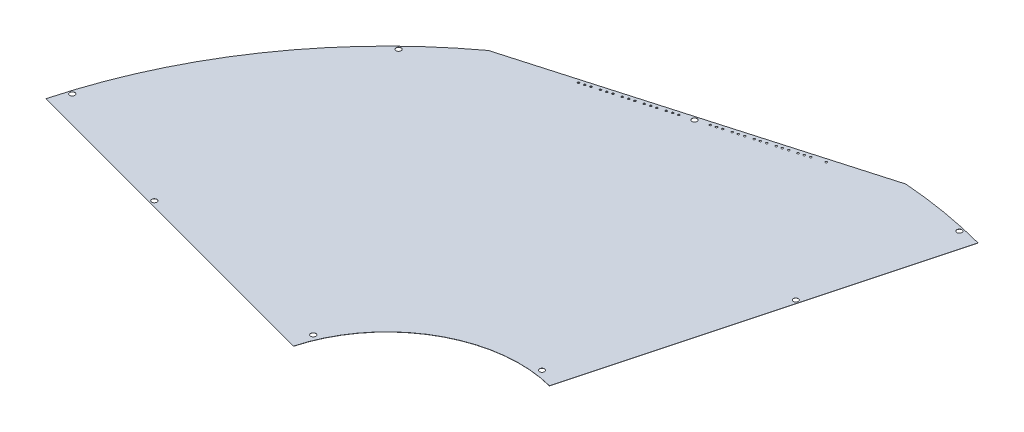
from build123d import *

# Parameters (mm, degrees)
SKETCH1_R      = 2
EXTRUDE1_DEPTH = 0.13
SKETCH3_R      = 0.75
EXTRUDE2_DEPTH = 529.801175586


with BuildPart() as part:
    # Sketch1 → Extrude1 (new body)
    with BuildSketch(Plane(origin=(0, 0, 0), x_dir=(1, 0, 0), z_dir=(0, 1, 0))):
        with BuildLine():
            Line((29.528359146, 379.854019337), (-226.333431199, 306.486831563))
            ThreePointArc((-226.333431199, 306.486831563), (-314.686889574, 214.786315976), (-367.888013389, 99.092934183))
            Line((-367.888013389, 99.092934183), (-101.29165232, 27.658654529))
            ThreePointArc((-101.29165232, 27.658654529), (-52.5, 90.932667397), (26.692728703, 101.550471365))
            Line((26.692728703, 101.550471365), (98.127008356, 368.146832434))
            ThreePointArc((98.127008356, 368.146832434), (64.095536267, 375.569916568), (29.528359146, 379.854019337))
        make_face()
        with Locations(Location((-360.801175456, 112.723164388, 0), (0, 0, 270))):
            Circle(SKETCH1_R, mode=Mode.SUBTRACT)
        with Locations(Location((-262.580864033, 271.910444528, 0), (0, 0, 270))):
            Circle(SKETCH1_R, mode=Mode.SUBTRACT)
        with Locations(Location((-101.180022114, 43.157886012, 0), (0, 0, 270))):
            Circle(SKETCH1_R, mode=Mode.SUBTRACT)
        with Locations(Location((-97.575623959, 340.286640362, 0), (0, 0, 270))):
            Circle(SKETCH1_R, mode=Mode.SUBTRACT)
        with Locations(Location((13.214185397, 109.203412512, 0), (0, 0, 270))):
            Circle(SKETCH1_R, mode=Mode.SUBTRACT)
        with Locations(Location((82.779463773, 368.824565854, 0), (0, 0, 270))):
            Circle(SKETCH1_R, mode=Mode.SUBTRACT)
        with Locations(Location((65.311626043, 257.269268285, 0), (0, 0, 270))):
            Circle(SKETCH1_R, mode=Mode.SUBTRACT)
        with Locations(Location((-255.457534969, 72.073106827, 0), (0, 0, 270))):
            Circle(SKETCH1_R, mode=Mode.SUBTRACT)
    extrude(amount=EXTRUDE1_DEPTH)

    # Sketch3 → Extrude2 (cut, through all)
    with BuildSketch(Plane.XZ):
        with Locations(Location((-107.188240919, -337.530266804, 0), (0, 0, 270))):
            Circle(SKETCH3_R)
        with Locations(Location((-120.645904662, -333.671343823, 0), (0, 0, 270))):
            Circle(SKETCH3_R)
        with Locations(Location((-124.490951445, -332.568794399, 0), (0, 0, 270))):
            Circle(SKETCH3_R)
        with Locations(Location((-111.033287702, -336.427717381, 0), (0, 0, 270))):
            Circle(SKETCH3_R)
        with Locations(Location((-114.878334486, -335.325167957, 0), (0, 0, 270))):
            Circle(SKETCH3_R)
        with Locations(Location((-128.335998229, -331.466244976, 0), (0, 0, 270))):
            Circle(SKETCH3_R)
        with Locations(Location((-134.103568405, -329.812420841, 0), (0, 0, 270))):
            Circle(SKETCH3_R)
        with Locations(Location((-137.948615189, -328.709871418, 0), (0, 0, 270))):
            Circle(SKETCH3_R)
        with Locations(Location((-141.793661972, -327.607321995, 0), (0, 0, 270))):
            Circle(SKETCH3_R)
        with Locations(Location((-147.561232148, -325.95349786, 0), (0, 0, 270))):
            Circle(SKETCH3_R)
        with Locations(Location((-151.406278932, -324.850948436, 0), (0, 0, 270))):
            Circle(SKETCH3_R)
        with Locations(Location((-155.251325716, -323.748399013, 0), (0, 0, 270))):
            Circle(SKETCH3_R)
        with Locations(Location((-161.018895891, -322.094574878, 0), (0, 0, 270))):
            Circle(SKETCH3_R)
        with Locations(Location((-164.863942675, -320.992025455, 0), (0, 0, 270))):
            Circle(SKETCH3_R)
        with Locations(Location((-168.708989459, -319.889476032, 0), (0, 0, 270))):
            Circle(SKETCH3_R)
        with Locations(Location((-26.44225846, -360.683804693, 0), (0, 0, 90))):
            Circle(SKETCH3_R)
        with Locations(Location((-30.287305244, -359.581255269, 0), (0, 0, 90))):
            Circle(SKETCH3_R)
        with Locations(Location((-34.132352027, -358.478705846, 0), (0, 0, 90))):
            Circle(SKETCH3_R)
        with Locations(Location((-39.899922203, -356.824881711, 0), (0, 0, 90))):
            Circle(SKETCH3_R)
        with Locations(Location((-43.744968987, -355.722332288, 0), (0, 0, 90))):
            Circle(SKETCH3_R)
        with Locations(Location((-47.59001577, -354.619782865, 0), (0, 0, 90))):
            Circle(SKETCH3_R)
        with Locations(Location((-53.357585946, -352.96595873, 0), (0, 0, 90))):
            Circle(SKETCH3_R)
        with Locations(Location((-57.20263273, -351.863409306, 0), (0, 0, 90))):
            Circle(SKETCH3_R)
        with Locations(Location((-61.047679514, -350.760859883, 0), (0, 0, 90))):
            Circle(SKETCH3_R)
        with Locations(Location((-66.815249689, -349.107035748, 0), (0, 0, 90))):
            Circle(SKETCH3_R)
        with Locations(Location((-80.272913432, -345.248112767, 0), (0, 0, 90))):
            Circle(SKETCH3_R)
        with Locations(Location((-84.117960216, -344.145563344, 0), (0, 0, 90))):
            Circle(SKETCH3_R)
        with Locations(Location((-70.660296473, -348.004486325, 0), (0, 0, 90))):
            Circle(SKETCH3_R)
        with Locations(Location((-74.505343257, -346.901936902, 0), (0, 0, 90))):
            Circle(SKETCH3_R)
        with Locations(Location((-87.963007, -343.04301392, 0), (0, 0, 90))):
            Circle(SKETCH3_R)
        with Locations(Location((-16.8296415, -363.440178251, 0), (0, 0, 270))):
            Circle(SKETCH3_R)
    extrude(amount=-EXTRUDE2_DEPTH, mode=Mode.SUBTRACT)


solid = part.part
